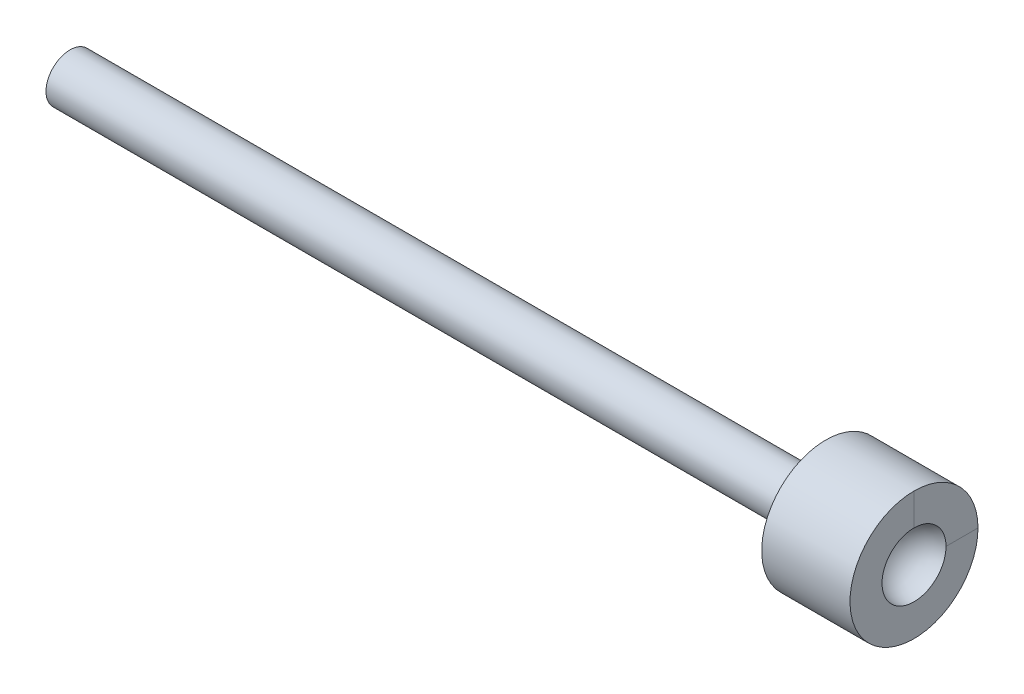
ISO-10303-21;
HEADER;
FILE_DESCRIPTION(('STEP AP214'),'2;1');
FILE_NAME('part.step','',(''),(''),'','','');
FILE_SCHEMA(('AUTOMOTIVE_DESIGN { 1 0 10303 214 1 1 1 1 }'));
ENDSEC;
DATA;
#1=APPLICATION_CONTEXT('core data for automotive mechanical design processes');
#2=APPLICATION_PROTOCOL_DEFINITION('international standard','automotive_design',2000,#1);
#3=PRODUCT_CONTEXT('',#1,'mechanical');
#4=PRODUCT('Part','Part','',(#3));
#5=PRODUCT_RELATED_PRODUCT_CATEGORY('part','',(#4));
#6=PRODUCT_DEFINITION_FORMATION('','',#4);
#7=PRODUCT_DEFINITION_CONTEXT('part definition',#1,'design');
#8=PRODUCT_DEFINITION('design','',#6,#7);
#9=PRODUCT_DEFINITION_SHAPE('','',#8);
#10=(LENGTH_UNIT() NAMED_UNIT(*) SI_UNIT(.MILLI.,.METRE.));
#11=(NAMED_UNIT(*) PLANE_ANGLE_UNIT() SI_UNIT($,.RADIAN.));
#12=(NAMED_UNIT(*) SI_UNIT($,.STERADIAN.) SOLID_ANGLE_UNIT());
#13=UNCERTAINTY_MEASURE_WITH_UNIT(LENGTH_MEASURE(1.E-05),#10,'distance_accuracy_value','');
#14=(GEOMETRIC_REPRESENTATION_CONTEXT(3) GLOBAL_UNCERTAINTY_ASSIGNED_CONTEXT((#13)) GLOBAL_UNIT_ASSIGNED_CONTEXT((#10,
#11,#12)) REPRESENTATION_CONTEXT('',''));
#15=CARTESIAN_POINT('',(0.,0.,0.));
#16=DIRECTION('',(0.,0.,1.));
#17=DIRECTION('',(1.,0.,0.));
#18=AXIS2_PLACEMENT_3D('',#15,#16,#17);
#19=CARTESIAN_POINT('',(185.039,0.,0.));
#20=DIRECTION('',(1.,0.,0.));
#21=DIRECTION('',(0.,0.,-1.));
#22=AXIS2_PLACEMENT_3D('',#19,#20,#21);
#23=PLANE('',#22);
#24=CARTESIAN_POINT('',(185.039,0.,0.));
#25=DIRECTION('',(1.,0.,0.));
#26=DIRECTION('',(0.,0.,-1.));
#27=AXIS2_PLACEMENT_3D('',#24,#25,#26);
#28=CIRCLE('',#27,12.7);
#29=CARTESIAN_POINT('',(185.039,0.,-12.7));
#30=VERTEX_POINT('',#29);
#31=CARTESIAN_POINT('',(185.039,12.7,0.));
#32=VERTEX_POINT('',#31);
#33=EDGE_CURVE('E78',#30,#32,#28,.F.);
#34=ORIENTED_EDGE('',*,*,#33,.T.);
#35=DIRECTION('',(0.,1.,0.));
#36=VECTOR('',#35,1.);
#37=CARTESIAN_POINT('',(185.039,0.,0.));
#38=LINE('',#37,#36);
#39=CARTESIAN_POINT('',(185.039,25.4,0.));
#40=VERTEX_POINT('',#39);
#41=EDGE_CURVE('E11',#32,#40,#38,.T.);
#42=ORIENTED_EDGE('',*,*,#41,.T.);
#43=CARTESIAN_POINT('',(185.039,0.,0.));
#44=DIRECTION('',(1.,0.,0.));
#45=DIRECTION('',(0.,0.,-1.));
#46=AXIS2_PLACEMENT_3D('',#43,#44,#45);
#47=CIRCLE('',#46,25.4);
#48=CARTESIAN_POINT('',(185.039,0.,-25.4));
#49=VERTEX_POINT('',#48);
#50=EDGE_CURVE('E67',#40,#49,#47,.T.);
#51=ORIENTED_EDGE('',*,*,#50,.T.);
#52=DIRECTION('',(0.,0.,1.));
#53=VECTOR('',#52,1.);
#54=CARTESIAN_POINT('',(185.039,0.,0.));
#55=LINE('',#54,#53);
#56=EDGE_CURVE('E43',#49,#30,#55,.T.);
#57=ORIENTED_EDGE('',*,*,#56,.T.);
#58=EDGE_LOOP('',(#34,#42,#51,#57));
#59=FACE_BOUND('',#58,.T.);
#60=ADVANCED_FACE('F34',(#59),#23,.T.);
#61=ORIENTED_EDGE('',*,*,#41,.F.);
#62=EDGE_CURVE('E62',#32,#30,#28,.F.);
#63=ORIENTED_EDGE('',*,*,#62,.T.);
#64=ORIENTED_EDGE('',*,*,#56,.F.);
#65=EDGE_CURVE('E61',#49,#40,#47,.T.);
#66=ORIENTED_EDGE('',*,*,#65,.T.);
#67=EDGE_LOOP('',(#61,#63,#64,#66));
#68=FACE_BOUND('',#67,.T.);
#69=ADVANCED_FACE('F59',(#68),#23,.T.);
#70=CARTESIAN_POINT('',(-149.987,9.52499999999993,0.));
#71=DIRECTION('',(1.,0.,0.));
#72=DIRECTION('',(0.,0.,-1.));
#73=AXIS2_PLACEMENT_3D('',#70,#71,#72);
#74=PLANE('',#73);
#75=CARTESIAN_POINT('',(-149.987,0.,0.));
#76=DIRECTION('',(-1.,0.,0.));
#77=DIRECTION('',(0.,0.,1.));
#78=AXIS2_PLACEMENT_3D('',#75,#76,#77);
#79=CIRCLE('',#78,9.52499999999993);
#80=CARTESIAN_POINT('',(-149.987,0.,9.52499999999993));
#81=VERTEX_POINT('',#80);
#82=EDGE_CURVE('E65',#81,#81,#79,.T.);
#83=ORIENTED_EDGE('',*,*,#82,.T.);
#84=EDGE_LOOP('',(#83));
#85=FACE_BOUND('',#84,.T.);
#86=ADVANCED_FACE('F36',(#85),#74,.F.);
#87=CARTESIAN_POINT('',(-167.819108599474,0.,0.));
#88=DIRECTION('',(-1.,0.,0.));
#89=DIRECTION('',(0.,0.,1.));
#90=AXIS2_PLACEMENT_3D('',#87,#88,#89);
#91=CYLINDRICAL_SURFACE('',#90,9.52499999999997);
#92=ORIENTED_EDGE('',*,*,#82,.F.);
#93=EDGE_LOOP('',(#92));
#94=FACE_BOUND('',#93,.T.);
#95=CARTESIAN_POINT('',(149.987,0.,0.));
#96=DIRECTION('',(1.,0.,0.));
#97=DIRECTION('',(0.,0.,-1.));
#98=AXIS2_PLACEMENT_3D('',#95,#96,#97);
#99=CIRCLE('',#98,9.52499999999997);
#100=CARTESIAN_POINT('',(149.987,0.,-9.52499999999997));
#101=VERTEX_POINT('',#100);
#102=EDGE_CURVE('E73',#101,#101,#99,.T.);
#103=ORIENTED_EDGE('',*,*,#102,.F.);
#104=EDGE_LOOP('',(#103));
#105=FACE_BOUND('',#104,.T.);
#106=ADVANCED_FACE('F98',(#94,#105),#91,.T.);
#107=CARTESIAN_POINT('',(149.987,0.,0.));
#108=DIRECTION('',(1.,0.,0.));
#109=DIRECTION('',(0.,0.,-1.));
#110=AXIS2_PLACEMENT_3D('',#107,#108,#109);
#111=PLANE('',#110);
#112=CARTESIAN_POINT('',(149.987,0.,0.));
#113=DIRECTION('',(1.,0.,0.));
#114=DIRECTION('',(0.,0.,-1.));
#115=AXIS2_PLACEMENT_3D('',#112,#113,#114);
#116=CIRCLE('',#115,25.4);
#117=CARTESIAN_POINT('',(149.987,0.,-25.4));
#118=VERTEX_POINT('',#117);
#119=EDGE_CURVE('E69',#118,#118,#116,.T.);
#120=ORIENTED_EDGE('',*,*,#119,.F.);
#121=EDGE_LOOP('',(#120));
#122=FACE_BOUND('',#121,.T.);
#123=ORIENTED_EDGE('',*,*,#102,.T.);
#124=EDGE_LOOP('',(#123));
#125=FACE_BOUND('',#124,.T.);
#126=ADVANCED_FACE('F89',(#122,#125),#111,.F.);
#127=CARTESIAN_POINT('',(185.039,0.,0.));
#128=DIRECTION('',(-1.,0.,0.));
#129=DIRECTION('',(0.,0.,1.));
#130=AXIS2_PLACEMENT_3D('',#127,#128,#129);
#131=CYLINDRICAL_SURFACE('',#130,25.4);
#132=ORIENTED_EDGE('',*,*,#65,.F.);
#133=ORIENTED_EDGE('',*,*,#50,.F.);
#134=EDGE_LOOP('',(#132,#133));
#135=FACE_BOUND('',#134,.T.);
#136=ORIENTED_EDGE('',*,*,#119,.T.);
#137=EDGE_LOOP('',(#136));
#138=FACE_BOUND('',#137,.T.);
#139=ADVANCED_FACE('F71',(#135,#138),#131,.T.);
#140=CARTESIAN_POINT('',(185.039,0.,0.));
#141=DIRECTION('',(-1.,0.,0.));
#142=DIRECTION('',(0.,1.,0.));
#143=AXIS2_PLACEMENT_3D('',#140,#141,#142);
#144=SPHERICAL_SURFACE('',#143,12.7);
#145=ORIENTED_EDGE('',*,*,#33,.F.);
#146=ORIENTED_EDGE('',*,*,#62,.F.);
#147=EDGE_LOOP('',(#145,#146));
#148=FACE_BOUND('',#147,.T.);
#149=ADVANCED_FACE('F83',(#148),#144,.F.);
#150=CLOSED_SHELL('',(#60,#69,#86,#106,#126,#139,#149));
#151=MANIFOLD_SOLID_BREP('B2',#150);
#152=ADVANCED_BREP_SHAPE_REPRESENTATION('',(#18,#151),#14);
#153=SHAPE_DEFINITION_REPRESENTATION(#9,#152);
ENDSEC;
END-ISO-10303-21;
